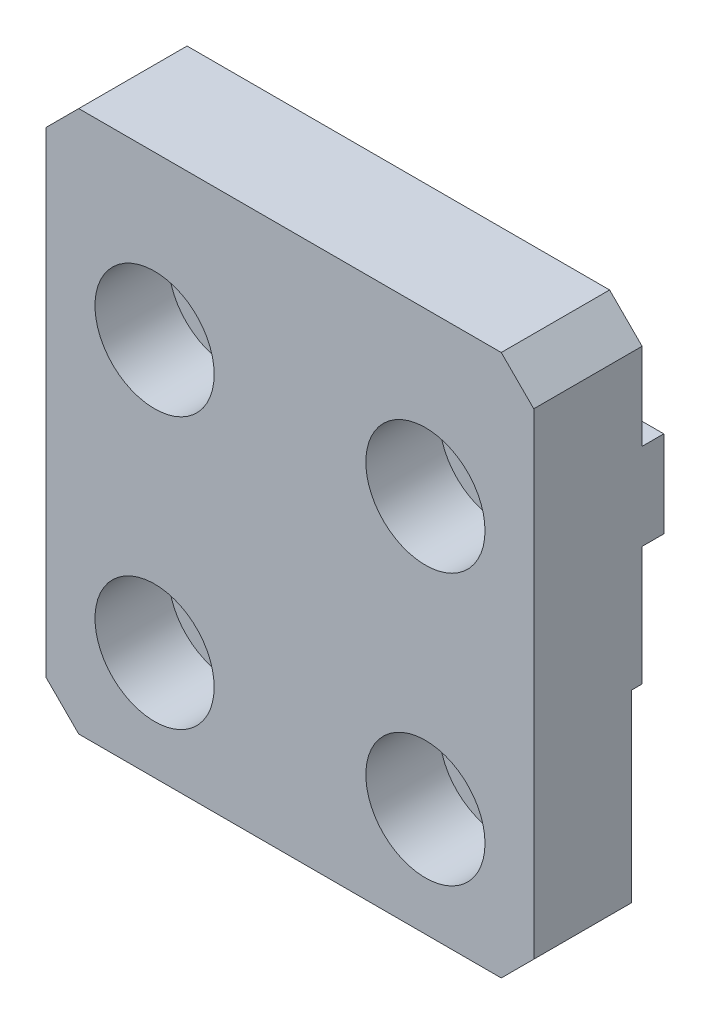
ISO-10303-21;
HEADER;
FILE_DESCRIPTION(('STEP AP214'),'2;1');
FILE_NAME('part.step','',(''),(''),'','','');
FILE_SCHEMA(('AUTOMOTIVE_DESIGN { 1 0 10303 214 1 1 1 1 }'));
ENDSEC;
DATA;
#1=APPLICATION_CONTEXT('core data for automotive mechanical design processes');
#2=APPLICATION_PROTOCOL_DEFINITION('international standard','automotive_design',2000,#1);
#3=PRODUCT_CONTEXT('',#1,'mechanical');
#4=PRODUCT('Part','Part','',(#3));
#5=PRODUCT_RELATED_PRODUCT_CATEGORY('part','',(#4));
#6=PRODUCT_DEFINITION_FORMATION('','',#4);
#7=PRODUCT_DEFINITION_CONTEXT('part definition',#1,'design');
#8=PRODUCT_DEFINITION('design','',#6,#7);
#9=PRODUCT_DEFINITION_SHAPE('','',#8);
#10=(LENGTH_UNIT() NAMED_UNIT(*) SI_UNIT(.MILLI.,.METRE.));
#11=(NAMED_UNIT(*) PLANE_ANGLE_UNIT() SI_UNIT($,.RADIAN.));
#12=(NAMED_UNIT(*) SI_UNIT($,.STERADIAN.) SOLID_ANGLE_UNIT());
#13=UNCERTAINTY_MEASURE_WITH_UNIT(LENGTH_MEASURE(1.E-05),#10,'distance_accuracy_value','');
#14=(GEOMETRIC_REPRESENTATION_CONTEXT(3) GLOBAL_UNCERTAINTY_ASSIGNED_CONTEXT((#13)) GLOBAL_UNIT_ASSIGNED_CONTEXT((#10,
#11,#12)) REPRESENTATION_CONTEXT('',''));
#15=CARTESIAN_POINT('',(0.,0.,0.));
#16=DIRECTION('',(0.,0.,1.));
#17=DIRECTION('',(1.,0.,0.));
#18=AXIS2_PLACEMENT_3D('',#15,#16,#17);
#19=CARTESIAN_POINT('',(0.,0.,0.));
#20=DIRECTION('',(0.,0.,-1.));
#21=DIRECTION('',(-1.,0.,0.));
#22=AXIS2_PLACEMENT_3D('',#19,#20,#21);
#23=PLANE('',#22);
#24=DIRECTION('',(-1.,0.,0.));
#25=VECTOR('',#24,1.);
#26=CARTESIAN_POINT('',(263.,20.,0.));
#27=LINE('',#26,#25);
#28=CARTESIAN_POINT('',(305.,20.,0.));
#29=VERTEX_POINT('',#28);
#30=CARTESIAN_POINT('',(266.,20.,0.));
#31=VERTEX_POINT('',#30);
#32=EDGE_CURVE('E230',#29,#31,#27,.T.);
#33=ORIENTED_EDGE('',*,*,#32,.F.);
#34=DIRECTION('',(-0.707106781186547,0.707106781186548,0.));
#35=VECTOR('',#34,1.);
#36=CARTESIAN_POINT('',(162.5,162.5,0.));
#37=LINE('',#36,#35);
#38=CARTESIAN_POINT('',(308.,17.,0.));
#39=VERTEX_POINT('',#38);
#40=EDGE_CURVE('E297',#29,#39,#37,.F.);
#41=ORIENTED_EDGE('',*,*,#40,.T.);
#42=DIRECTION('',(0.,1.,0.));
#43=VECTOR('',#42,1.);
#44=CARTESIAN_POINT('',(308.,-30.,0.));
#45=LINE('',#44,#43);
#46=CARTESIAN_POINT('',(308.,9.,0.));
#47=VERTEX_POINT('',#46);
#48=EDGE_CURVE('E231',#47,#39,#45,.T.);
#49=ORIENTED_EDGE('',*,*,#48,.F.);
#50=DIRECTION('',(-1.,0.,0.));
#51=VECTOR('',#50,1.);
#52=CARTESIAN_POINT('',(308.,9.,0.));
#53=LINE('',#52,#51);
#54=CARTESIAN_POINT('',(263.,9.,0.));
#55=VERTEX_POINT('',#54);
#56=EDGE_CURVE('E215',#47,#55,#53,.T.);
#57=ORIENTED_EDGE('',*,*,#56,.T.);
#58=DIRECTION('',(0.,-1.,0.));
#59=VECTOR('',#58,1.);
#60=CARTESIAN_POINT('',(263.,-30.,0.));
#61=LINE('',#60,#59);
#62=CARTESIAN_POINT('',(263.,17.,0.));
#63=VERTEX_POINT('',#62);
#64=EDGE_CURVE('E244',#63,#55,#61,.T.);
#65=ORIENTED_EDGE('',*,*,#64,.F.);
#66=DIRECTION('',(-0.707106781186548,-0.707106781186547,0.));
#67=VECTOR('',#66,1.);
#68=CARTESIAN_POINT('',(123.,-123.,0.));
#69=LINE('',#68,#67);
#70=EDGE_CURVE('E31',#63,#31,#69,.F.);
#71=ORIENTED_EDGE('',*,*,#70,.T.);
#72=EDGE_LOOP('',(#33,#41,#49,#57,#65,#71));
#73=FACE_BOUND('',#72,.T.);
#74=ADVANCED_FACE('F16',(#73),#23,.T.);
#75=CARTESIAN_POINT('',(263.,-30.,10.));
#76=DIRECTION('',(1.,0.,0.));
#77=DIRECTION('',(0.,0.,-1.));
#78=AXIS2_PLACEMENT_3D('',#75,#76,#77);
#79=PLANE('',#78);
#80=DIRECTION('',(0.,-1.,0.));
#81=VECTOR('',#80,1.);
#82=CARTESIAN_POINT('',(263.,-30.,10.));
#83=LINE('',#82,#81);
#84=CARTESIAN_POINT('',(263.,17.,10.));
#85=VERTEX_POINT('',#84);
#86=CARTESIAN_POINT('',(263.,-27.,10.));
#87=VERTEX_POINT('',#86);
#88=EDGE_CURVE('E254',#85,#87,#83,.T.);
#89=ORIENTED_EDGE('',*,*,#88,.F.);
#90=DIRECTION('',(0.,0.,-1.));
#91=VECTOR('',#90,1.);
#92=CARTESIAN_POINT('',(263.,17.,10.));
#93=LINE('',#92,#91);
#94=EDGE_CURVE('E11',#85,#63,#93,.T.);
#95=ORIENTED_EDGE('',*,*,#94,.T.);
#96=ORIENTED_EDGE('',*,*,#64,.T.);
#97=DIRECTION('',(0.,0.,-1.));
#98=VECTOR('',#97,1.);
#99=CARTESIAN_POINT('',(263.,9.,0.));
#100=LINE('',#99,#98);
#101=CARTESIAN_POINT('',(263.,9.,-2.));
#102=VERTEX_POINT('',#101);
#103=EDGE_CURVE('E202',#55,#102,#100,.T.);
#104=ORIENTED_EDGE('',*,*,#103,.T.);
#105=DIRECTION('',(0.,-1.,0.));
#106=VECTOR('',#105,1.);
#107=CARTESIAN_POINT('',(263.,1.,-2.));
#108=LINE('',#107,#106);
#109=CARTESIAN_POINT('',(263.,1.,-2.));
#110=VERTEX_POINT('',#109);
#111=EDGE_CURVE('E198',#102,#110,#108,.T.);
#112=ORIENTED_EDGE('',*,*,#111,.T.);
#113=DIRECTION('',(0.,0.,1.));
#114=VECTOR('',#113,1.);
#115=CARTESIAN_POINT('',(263.,1.,0.));
#116=LINE('',#115,#114);
#117=CARTESIAN_POINT('',(263.,1.,0.));
#118=VERTEX_POINT('',#117);
#119=EDGE_CURVE('E201',#110,#118,#116,.T.);
#120=ORIENTED_EDGE('',*,*,#119,.T.);
#121=CARTESIAN_POINT('',(263.,-10.,0.));
#122=VERTEX_POINT('',#121);
#123=EDGE_CURVE('E143',#118,#122,#61,.T.);
#124=ORIENTED_EDGE('',*,*,#123,.T.);
#125=DIRECTION('',(0.,0.,-1.));
#126=VECTOR('',#125,1.);
#127=CARTESIAN_POINT('',(263.,-10.,0.));
#128=LINE('',#127,#126);
#129=CARTESIAN_POINT('',(263.,-10.,1.));
#130=VERTEX_POINT('',#129);
#131=EDGE_CURVE('E127',#130,#122,#128,.T.);
#132=ORIENTED_EDGE('',*,*,#131,.F.);
#133=DIRECTION('',(0.,1.,0.));
#134=VECTOR('',#133,1.);
#135=CARTESIAN_POINT('',(263.,-30.,1.));
#136=LINE('',#135,#134);
#137=CARTESIAN_POINT('',(263.,-27.,1.));
#138=VERTEX_POINT('',#137);
#139=EDGE_CURVE('E117',#138,#130,#136,.T.);
#140=ORIENTED_EDGE('',*,*,#139,.F.);
#141=DIRECTION('',(0.,0.,1.));
#142=VECTOR('',#141,1.);
#143=CARTESIAN_POINT('',(263.,-27.,10.));
#144=LINE('',#143,#142);
#145=EDGE_CURVE('E24',#138,#87,#144,.T.);
#146=ORIENTED_EDGE('',*,*,#145,.T.);
#147=EDGE_LOOP('',(#89,#95,#96,#104,#112,#120,#124,#132,#140,#146));
#148=FACE_BOUND('',#147,.T.);
#149=ADVANCED_FACE('F140',(#148),#79,.F.);
#150=CARTESIAN_POINT('',(263.,-30.,10.));
#151=DIRECTION('',(0.,1.,0.));
#152=DIRECTION('',(0.,0.,1.));
#153=AXIS2_PLACEMENT_3D('',#150,#151,#152);
#154=PLANE('',#153);
#155=DIRECTION('',(-1.,0.,0.));
#156=VECTOR('',#155,1.);
#157=CARTESIAN_POINT('',(308.00005,-30.,1.));
#158=LINE('',#157,#156);
#159=CARTESIAN_POINT('',(305.,-30.,1.));
#160=VERTEX_POINT('',#159);
#161=CARTESIAN_POINT('',(266.,-30.,1.));
#162=VERTEX_POINT('',#161);
#163=EDGE_CURVE('E136',#160,#162,#158,.T.);
#164=ORIENTED_EDGE('',*,*,#163,.F.);
#165=DIRECTION('',(0.,0.,1.));
#166=VECTOR('',#165,1.);
#167=CARTESIAN_POINT('',(305.,-30.,10.));
#168=LINE('',#167,#166);
#169=CARTESIAN_POINT('',(305.,-30.,10.));
#170=VERTEX_POINT('',#169);
#171=EDGE_CURVE('E280',#160,#170,#168,.T.);
#172=ORIENTED_EDGE('',*,*,#171,.T.);
#173=DIRECTION('',(1.,0.,0.));
#174=VECTOR('',#173,1.);
#175=CARTESIAN_POINT('',(263.,-30.,10.));
#176=LINE('',#175,#174);
#177=CARTESIAN_POINT('',(266.,-30.,10.));
#178=VERTEX_POINT('',#177);
#179=EDGE_CURVE('E257',#178,#170,#176,.T.);
#180=ORIENTED_EDGE('',*,*,#179,.F.);
#181=DIRECTION('',(0.,0.,-1.));
#182=VECTOR('',#181,1.);
#183=CARTESIAN_POINT('',(266.,-30.,10.));
#184=LINE('',#183,#182);
#185=EDGE_CURVE('E277',#178,#162,#184,.T.);
#186=ORIENTED_EDGE('',*,*,#185,.T.);
#187=EDGE_LOOP('',(#164,#172,#180,#186));
#188=FACE_BOUND('',#187,.T.);
#189=ADVANCED_FACE('F305',(#188),#154,.F.);
#190=CARTESIAN_POINT('',(308.,-30.,10.));
#191=DIRECTION('',(-1.,0.,0.));
#192=DIRECTION('',(0.,0.,1.));
#193=AXIS2_PLACEMENT_3D('',#190,#191,#192);
#194=PLANE('',#193);
#195=DIRECTION('',(0.,1.,0.));
#196=VECTOR('',#195,1.);
#197=CARTESIAN_POINT('',(308.,-30.,10.));
#198=LINE('',#197,#196);
#199=CARTESIAN_POINT('',(308.,-27.,10.));
#200=VERTEX_POINT('',#199);
#201=CARTESIAN_POINT('',(308.,17.,10.));
#202=VERTEX_POINT('',#201);
#203=EDGE_CURVE('E260',#200,#202,#198,.T.);
#204=ORIENTED_EDGE('',*,*,#203,.F.);
#205=DIRECTION('',(0.,0.,-1.));
#206=VECTOR('',#205,1.);
#207=CARTESIAN_POINT('',(308.,-27.,10.));
#208=LINE('',#207,#206);
#209=CARTESIAN_POINT('',(308.,-27.,1.));
#210=VERTEX_POINT('',#209);
#211=EDGE_CURVE('E267',#200,#210,#208,.T.);
#212=ORIENTED_EDGE('',*,*,#211,.T.);
#213=DIRECTION('',(0.,1.,0.));
#214=VECTOR('',#213,1.);
#215=CARTESIAN_POINT('',(308.,-30.,1.));
#216=LINE('',#215,#214);
#217=CARTESIAN_POINT('',(308.,-10.,1.));
#218=VERTEX_POINT('',#217);
#219=EDGE_CURVE('E152',#210,#218,#216,.T.);
#220=ORIENTED_EDGE('',*,*,#219,.T.);
#221=DIRECTION('',(0.,0.,-1.));
#222=VECTOR('',#221,1.);
#223=CARTESIAN_POINT('',(308.,-10.,10.));
#224=LINE('',#223,#222);
#225=CARTESIAN_POINT('',(308.,-10.,0.));
#226=VERTEX_POINT('',#225);
#227=EDGE_CURVE('E134',#218,#226,#224,.T.);
#228=ORIENTED_EDGE('',*,*,#227,.T.);
#229=CARTESIAN_POINT('',(308.,1.,0.));
#230=VERTEX_POINT('',#229);
#231=EDGE_CURVE('E227',#226,#230,#45,.T.);
#232=ORIENTED_EDGE('',*,*,#231,.T.);
#233=DIRECTION('',(0.,0.,1.));
#234=VECTOR('',#233,1.);
#235=CARTESIAN_POINT('',(308.,1.,0.));
#236=LINE('',#235,#234);
#237=CARTESIAN_POINT('',(308.,1.,-2.));
#238=VERTEX_POINT('',#237);
#239=EDGE_CURVE('E196',#238,#230,#236,.T.);
#240=ORIENTED_EDGE('',*,*,#239,.F.);
#241=DIRECTION('',(0.,-1.,0.));
#242=VECTOR('',#241,1.);
#243=CARTESIAN_POINT('',(308.,1.,-2.));
#244=LINE('',#243,#242);
#245=CARTESIAN_POINT('',(308.,9.,-2.));
#246=VERTEX_POINT('',#245);
#247=EDGE_CURVE('E193',#246,#238,#244,.T.);
#248=ORIENTED_EDGE('',*,*,#247,.F.);
#249=DIRECTION('',(0.,0.,-1.));
#250=VECTOR('',#249,1.);
#251=CARTESIAN_POINT('',(308.,9.,0.));
#252=LINE('',#251,#250);
#253=EDGE_CURVE('E197',#47,#246,#252,.T.);
#254=ORIENTED_EDGE('',*,*,#253,.F.);
#255=ORIENTED_EDGE('',*,*,#48,.T.);
#256=DIRECTION('',(0.,0.,1.));
#257=VECTOR('',#256,1.);
#258=CARTESIAN_POINT('',(308.,17.,10.));
#259=LINE('',#258,#257);
#260=EDGE_CURVE('E232',#39,#202,#259,.T.);
#261=ORIENTED_EDGE('',*,*,#260,.T.);
#262=EDGE_LOOP('',(#204,#212,#220,#228,#232,#240,#248,#254,#255,#261));
#263=FACE_BOUND('',#262,.T.);
#264=ADVANCED_FACE('F311',(#263),#194,.F.);
#265=CARTESIAN_POINT('',(263.,20.,10.));
#266=DIRECTION('',(0.,-1.,0.));
#267=DIRECTION('',(0.,0.,-1.));
#268=AXIS2_PLACEMENT_3D('',#265,#266,#267);
#269=PLANE('',#268);
#270=DIRECTION('',(-1.,0.,0.));
#271=VECTOR('',#270,1.);
#272=CARTESIAN_POINT('',(263.,20.,10.));
#273=LINE('',#272,#271);
#274=CARTESIAN_POINT('',(305.,20.,10.));
#275=VERTEX_POINT('',#274);
#276=CARTESIAN_POINT('',(266.,20.,10.));
#277=VERTEX_POINT('',#276);
#278=EDGE_CURVE('E262',#275,#277,#273,.T.);
#279=ORIENTED_EDGE('',*,*,#278,.F.);
#280=DIRECTION('',(0.,0.,-1.));
#281=VECTOR('',#280,1.);
#282=CARTESIAN_POINT('',(305.,20.,10.));
#283=LINE('',#282,#281);
#284=EDGE_CURVE('E292',#275,#29,#283,.T.);
#285=ORIENTED_EDGE('',*,*,#284,.T.);
#286=ORIENTED_EDGE('',*,*,#32,.T.);
#287=DIRECTION('',(0.,0.,1.));
#288=VECTOR('',#287,1.);
#289=CARTESIAN_POINT('',(266.,20.,10.));
#290=LINE('',#289,#288);
#291=EDGE_CURVE('E290',#31,#277,#290,.T.);
#292=ORIENTED_EDGE('',*,*,#291,.T.);
#293=EDGE_LOOP('',(#279,#285,#286,#292));
#294=FACE_BOUND('',#293,.T.);
#295=ADVANCED_FACE('F313',(#294),#269,.F.);
#296=CARTESIAN_POINT('',(0.,0.,10.));
#297=DIRECTION('',(0.,0.,-1.));
#298=DIRECTION('',(-1.,0.,0.));
#299=AXIS2_PLACEMENT_3D('',#296,#297,#298);
#300=PLANE('',#299);
#301=CARTESIAN_POINT('',(273.,-20.,10.));
#302=DIRECTION('',(0.,0.,1.));
#303=DIRECTION('',(1.,0.,0.));
#304=AXIS2_PLACEMENT_3D('',#301,#302,#303);
#305=CIRCLE('',#304,5.5);
#306=CARTESIAN_POINT('',(278.5,-20.,10.));
#307=VERTEX_POINT('',#306);
#308=EDGE_CURVE('E155',#307,#307,#305,.T.);
#309=ORIENTED_EDGE('',*,*,#308,.F.);
#310=EDGE_LOOP('',(#309));
#311=FACE_BOUND('',#310,.T.);
#312=CARTESIAN_POINT('',(298.,-20.,10.));
#313=DIRECTION('',(0.,0.,1.));
#314=DIRECTION('',(1.,0.,0.));
#315=AXIS2_PLACEMENT_3D('',#312,#313,#314);
#316=CIRCLE('',#315,5.5);
#317=CARTESIAN_POINT('',(303.5,-20.,10.));
#318=VERTEX_POINT('',#317);
#319=EDGE_CURVE('E164',#318,#318,#316,.T.);
#320=ORIENTED_EDGE('',*,*,#319,.F.);
#321=EDGE_LOOP('',(#320));
#322=FACE_BOUND('',#321,.T.);
#323=CARTESIAN_POINT('',(273.,5.,10.));
#324=DIRECTION('',(0.,0.,1.));
#325=DIRECTION('',(1.,0.,0.));
#326=AXIS2_PLACEMENT_3D('',#323,#324,#325);
#327=CIRCLE('',#326,5.5);
#328=CARTESIAN_POINT('',(278.5,5.,10.));
#329=VERTEX_POINT('',#328);
#330=EDGE_CURVE('E173',#329,#329,#327,.T.);
#331=ORIENTED_EDGE('',*,*,#330,.F.);
#332=EDGE_LOOP('',(#331));
#333=FACE_BOUND('',#332,.T.);
#334=CARTESIAN_POINT('',(298.,5.,10.));
#335=DIRECTION('',(0.,0.,1.));
#336=DIRECTION('',(1.,0.,0.));
#337=AXIS2_PLACEMENT_3D('',#334,#335,#336);
#338=CIRCLE('',#337,5.5);
#339=CARTESIAN_POINT('',(303.5,5.,10.));
#340=VERTEX_POINT('',#339);
#341=EDGE_CURVE('E183',#340,#340,#338,.T.);
#342=ORIENTED_EDGE('',*,*,#341,.F.);
#343=EDGE_LOOP('',(#342));
#344=FACE_BOUND('',#343,.T.);
#345=ORIENTED_EDGE('',*,*,#179,.T.);
#346=DIRECTION('',(-0.707106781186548,-0.707106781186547,0.));
#347=VECTOR('',#346,1.);
#348=CARTESIAN_POINT('',(308.,-27.,10.));
#349=LINE('',#348,#347);
#350=EDGE_CURVE('E288',#170,#200,#349,.F.);
#351=ORIENTED_EDGE('',*,*,#350,.T.);
#352=ORIENTED_EDGE('',*,*,#203,.T.);
#353=DIRECTION('',(0.707106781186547,-0.707106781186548,0.));
#354=VECTOR('',#353,1.);
#355=CARTESIAN_POINT('',(305.,20.,10.));
#356=LINE('',#355,#354);
#357=EDGE_CURVE('E286',#202,#275,#356,.F.);
#358=ORIENTED_EDGE('',*,*,#357,.T.);
#359=ORIENTED_EDGE('',*,*,#278,.T.);
#360=DIRECTION('',(0.707106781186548,0.707106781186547,0.));
#361=VECTOR('',#360,1.);
#362=CARTESIAN_POINT('',(263.,17.,10.));
#363=LINE('',#362,#361);
#364=EDGE_CURVE('E284',#277,#85,#363,.F.);
#365=ORIENTED_EDGE('',*,*,#364,.T.);
#366=ORIENTED_EDGE('',*,*,#88,.T.);
#367=DIRECTION('',(-0.707106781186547,0.707106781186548,0.));
#368=VECTOR('',#367,1.);
#369=CARTESIAN_POINT('',(266.,-30.,10.));
#370=LINE('',#369,#368);
#371=EDGE_CURVE('E282',#87,#178,#370,.F.);
#372=ORIENTED_EDGE('',*,*,#371,.T.);
#373=EDGE_LOOP('',(#345,#351,#352,#358,#359,#365,#366,#372));
#374=FACE_BOUND('',#373,.T.);
#375=ADVANCED_FACE('F300',(#311,#322,#333,#344,#374),#300,.F.);
#376=DIRECTION('',(-1.,0.,0.));
#377=VECTOR('',#376,1.);
#378=CARTESIAN_POINT('',(308.00005,-10.,0.));
#379=LINE('',#378,#377);
#380=EDGE_CURVE('E135',#226,#122,#379,.T.);
#381=ORIENTED_EDGE('',*,*,#380,.T.);
#382=ORIENTED_EDGE('',*,*,#123,.F.);
#383=DIRECTION('',(-1.,0.,0.));
#384=VECTOR('',#383,1.);
#385=CARTESIAN_POINT('',(308.,1.,0.));
#386=LINE('',#385,#384);
#387=EDGE_CURVE('E208',#230,#118,#386,.T.);
#388=ORIENTED_EDGE('',*,*,#387,.F.);
#389=ORIENTED_EDGE('',*,*,#231,.F.);
#390=EDGE_LOOP('',(#381,#382,#388,#389));
#391=FACE_BOUND('',#390,.T.);
#392=ADVANCED_FACE('F326',(#391),#23,.T.);
#393=CARTESIAN_POINT('',(308.,1.,0.));
#394=DIRECTION('',(0.,-1.,0.));
#395=DIRECTION('',(0.,0.,-1.));
#396=AXIS2_PLACEMENT_3D('',#393,#394,#395);
#397=PLANE('',#396);
#398=ORIENTED_EDGE('',*,*,#119,.F.);
#399=DIRECTION('',(-1.,0.,0.));
#400=VECTOR('',#399,1.);
#401=CARTESIAN_POINT('',(308.,1.,-2.));
#402=LINE('',#401,#400);
#403=EDGE_CURVE('E205',#238,#110,#402,.T.);
#404=ORIENTED_EDGE('',*,*,#403,.F.);
#405=ORIENTED_EDGE('',*,*,#239,.T.);
#406=ORIENTED_EDGE('',*,*,#387,.T.);
#407=EDGE_LOOP('',(#398,#404,#405,#406));
#408=FACE_BOUND('',#407,.T.);
#409=ADVANCED_FACE('F334',(#408),#397,.T.);
#410=CARTESIAN_POINT('',(308.,1.,-2.));
#411=DIRECTION('',(0.,0.,-1.));
#412=DIRECTION('',(-1.,0.,0.));
#413=AXIS2_PLACEMENT_3D('',#410,#411,#412);
#414=PLANE('',#413);
#415=CARTESIAN_POINT('',(273.,5.,-2.));
#416=DIRECTION('',(0.,0.,-1.));
#417=DIRECTION('',(-1.,0.,0.));
#418=AXIS2_PLACEMENT_3D('',#415,#416,#417);
#419=CIRCLE('',#418,3.3);
#420=CARTESIAN_POINT('',(269.7,5.,-2.));
#421=VERTEX_POINT('',#420);
#422=EDGE_CURVE('E182',#421,#421,#419,.T.);
#423=ORIENTED_EDGE('',*,*,#422,.F.);
#424=EDGE_LOOP('',(#423));
#425=FACE_BOUND('',#424,.T.);
#426=CARTESIAN_POINT('',(298.,5.,-2.));
#427=DIRECTION('',(0.,0.,-1.));
#428=DIRECTION('',(-1.,0.,0.));
#429=AXIS2_PLACEMENT_3D('',#426,#427,#428);
#430=CIRCLE('',#429,3.3);
#431=CARTESIAN_POINT('',(294.7,5.,-2.));
#432=VERTEX_POINT('',#431);
#433=EDGE_CURVE('E192',#432,#432,#430,.T.);
#434=ORIENTED_EDGE('',*,*,#433,.F.);
#435=EDGE_LOOP('',(#434));
#436=FACE_BOUND('',#435,.T.);
#437=ORIENTED_EDGE('',*,*,#111,.F.);
#438=DIRECTION('',(-1.,0.,0.));
#439=VECTOR('',#438,1.);
#440=CARTESIAN_POINT('',(308.,9.,-2.));
#441=LINE('',#440,#439);
#442=EDGE_CURVE('E251',#246,#102,#441,.T.);
#443=ORIENTED_EDGE('',*,*,#442,.F.);
#444=ORIENTED_EDGE('',*,*,#247,.T.);
#445=ORIENTED_EDGE('',*,*,#403,.T.);
#446=EDGE_LOOP('',(#437,#443,#444,#445));
#447=FACE_BOUND('',#446,.T.);
#448=ADVANCED_FACE('F341',(#425,#436,#447),#414,.T.);
#449=CARTESIAN_POINT('',(308.,9.,0.));
#450=DIRECTION('',(0.,1.,0.));
#451=DIRECTION('',(0.,0.,1.));
#452=AXIS2_PLACEMENT_3D('',#449,#450,#451);
#453=PLANE('',#452);
#454=ORIENTED_EDGE('',*,*,#103,.F.);
#455=ORIENTED_EDGE('',*,*,#56,.F.);
#456=ORIENTED_EDGE('',*,*,#253,.T.);
#457=ORIENTED_EDGE('',*,*,#442,.T.);
#458=EDGE_LOOP('',(#454,#455,#456,#457));
#459=FACE_BOUND('',#458,.T.);
#460=ADVANCED_FACE('F357',(#459),#453,.T.);
#461=CARTESIAN_POINT('',(298.,5.,10.));
#462=DIRECTION('',(0.,0.,1.));
#463=DIRECTION('',(1.,0.,0.));
#464=AXIS2_PLACEMENT_3D('',#461,#462,#463);
#465=CYLINDRICAL_SURFACE('',#464,3.3);
#466=ORIENTED_EDGE('',*,*,#433,.T.);
#467=EDGE_LOOP('',(#466));
#468=FACE_BOUND('',#467,.T.);
#469=CARTESIAN_POINT('',(298.,5.,3.2));
#470=DIRECTION('',(0.,0.,1.));
#471=DIRECTION('',(1.,0.,0.));
#472=AXIS2_PLACEMENT_3D('',#469,#470,#471);
#473=CIRCLE('',#472,3.3);
#474=CARTESIAN_POINT('',(301.3,5.,3.2));
#475=VERTEX_POINT('',#474);
#476=EDGE_CURVE('E189',#475,#475,#473,.T.);
#477=ORIENTED_EDGE('',*,*,#476,.T.);
#478=EDGE_LOOP('',(#477));
#479=FACE_BOUND('',#478,.T.);
#480=ADVANCED_FACE('F428',(#468,#479),#465,.F.);
#481=CARTESIAN_POINT('',(301.3,5.,3.2));
#482=DIRECTION('',(0.,0.,-1.));
#483=DIRECTION('',(-1.,0.,0.));
#484=AXIS2_PLACEMENT_3D('',#481,#482,#483);
#485=PLANE('',#484);
#486=ORIENTED_EDGE('',*,*,#476,.F.);
#487=EDGE_LOOP('',(#486));
#488=FACE_BOUND('',#487,.T.);
#489=CARTESIAN_POINT('',(298.,5.,3.2));
#490=DIRECTION('',(0.,0.,1.));
#491=DIRECTION('',(1.,0.,0.));
#492=AXIS2_PLACEMENT_3D('',#489,#490,#491);
#493=CIRCLE('',#492,5.5);
#494=CARTESIAN_POINT('',(303.5,5.,3.2));
#495=VERTEX_POINT('',#494);
#496=EDGE_CURVE('E186',#495,#495,#493,.T.);
#497=ORIENTED_EDGE('',*,*,#496,.T.);
#498=EDGE_LOOP('',(#497));
#499=FACE_BOUND('',#498,.T.);
#500=ADVANCED_FACE('F424',(#488,#499),#485,.F.);
#501=CARTESIAN_POINT('',(298.,5.,10.));
#502=DIRECTION('',(0.,0.,1.));
#503=DIRECTION('',(1.,0.,0.));
#504=AXIS2_PLACEMENT_3D('',#501,#502,#503);
#505=CYLINDRICAL_SURFACE('',#504,5.5);
#506=ORIENTED_EDGE('',*,*,#496,.F.);
#507=EDGE_LOOP('',(#506));
#508=FACE_BOUND('',#507,.T.);
#509=ORIENTED_EDGE('',*,*,#341,.T.);
#510=EDGE_LOOP('',(#509));
#511=FACE_BOUND('',#510,.T.);
#512=ADVANCED_FACE('F420',(#508,#511),#505,.F.);
#513=CARTESIAN_POINT('',(273.,5.,10.));
#514=DIRECTION('',(0.,0.,1.));
#515=DIRECTION('',(1.,0.,0.));
#516=AXIS2_PLACEMENT_3D('',#513,#514,#515);
#517=CYLINDRICAL_SURFACE('',#516,3.3);
#518=ORIENTED_EDGE('',*,*,#422,.T.);
#519=EDGE_LOOP('',(#518));
#520=FACE_BOUND('',#519,.T.);
#521=CARTESIAN_POINT('',(273.,5.,3.2));
#522=DIRECTION('',(0.,0.,1.));
#523=DIRECTION('',(1.,0.,0.));
#524=AXIS2_PLACEMENT_3D('',#521,#522,#523);
#525=CIRCLE('',#524,3.3);
#526=CARTESIAN_POINT('',(276.3,5.,3.2));
#527=VERTEX_POINT('',#526);
#528=EDGE_CURVE('E179',#527,#527,#525,.T.);
#529=ORIENTED_EDGE('',*,*,#528,.T.);
#530=EDGE_LOOP('',(#529));
#531=FACE_BOUND('',#530,.T.);
#532=ADVANCED_FACE('F416',(#520,#531),#517,.F.);
#533=CARTESIAN_POINT('',(276.3,5.,3.2));
#534=DIRECTION('',(0.,0.,-1.));
#535=DIRECTION('',(-1.,0.,0.));
#536=AXIS2_PLACEMENT_3D('',#533,#534,#535);
#537=PLANE('',#536);
#538=ORIENTED_EDGE('',*,*,#528,.F.);
#539=EDGE_LOOP('',(#538));
#540=FACE_BOUND('',#539,.T.);
#541=CARTESIAN_POINT('',(273.,5.,3.2));
#542=DIRECTION('',(0.,0.,1.));
#543=DIRECTION('',(1.,0.,0.));
#544=AXIS2_PLACEMENT_3D('',#541,#542,#543);
#545=CIRCLE('',#544,5.5);
#546=CARTESIAN_POINT('',(278.5,5.,3.2));
#547=VERTEX_POINT('',#546);
#548=EDGE_CURVE('E176',#547,#547,#545,.T.);
#549=ORIENTED_EDGE('',*,*,#548,.T.);
#550=EDGE_LOOP('',(#549));
#551=FACE_BOUND('',#550,.T.);
#552=ADVANCED_FACE('F412',(#540,#551),#537,.F.);
#553=CARTESIAN_POINT('',(273.,5.,10.));
#554=DIRECTION('',(0.,0.,1.));
#555=DIRECTION('',(1.,0.,0.));
#556=AXIS2_PLACEMENT_3D('',#553,#554,#555);
#557=CYLINDRICAL_SURFACE('',#556,5.5);
#558=ORIENTED_EDGE('',*,*,#548,.F.);
#559=EDGE_LOOP('',(#558));
#560=FACE_BOUND('',#559,.T.);
#561=ORIENTED_EDGE('',*,*,#330,.T.);
#562=EDGE_LOOP('',(#561));
#563=FACE_BOUND('',#562,.T.);
#564=ADVANCED_FACE('F408',(#560,#563),#557,.F.);
#565=CARTESIAN_POINT('',(298.,-20.,10.));
#566=DIRECTION('',(0.,0.,1.));
#567=DIRECTION('',(1.,0.,0.));
#568=AXIS2_PLACEMENT_3D('',#565,#566,#567);
#569=CYLINDRICAL_SURFACE('',#568,3.3);
#570=CARTESIAN_POINT('',(298.,-20.,1.));
#571=DIRECTION('',(0.,0.,1.));
#572=DIRECTION('',(1.,0.,0.));
#573=AXIS2_PLACEMENT_3D('',#570,#571,#572);
#574=CIRCLE('',#573,3.3);
#575=CARTESIAN_POINT('',(301.3,-20.,1.));
#576=VERTEX_POINT('',#575);
#577=EDGE_CURVE('E149',#576,#576,#574,.F.);
#578=ORIENTED_EDGE('',*,*,#577,.T.);
#579=EDGE_LOOP('',(#578));
#580=FACE_BOUND('',#579,.T.);
#581=CARTESIAN_POINT('',(298.,-20.,3.2));
#582=DIRECTION('',(0.,0.,1.));
#583=DIRECTION('',(1.,0.,0.));
#584=AXIS2_PLACEMENT_3D('',#581,#582,#583);
#585=CIRCLE('',#584,3.3);
#586=CARTESIAN_POINT('',(301.3,-20.,3.2));
#587=VERTEX_POINT('',#586);
#588=EDGE_CURVE('E170',#587,#587,#585,.T.);
#589=ORIENTED_EDGE('',*,*,#588,.T.);
#590=EDGE_LOOP('',(#589));
#591=FACE_BOUND('',#590,.T.);
#592=ADVANCED_FACE('F404',(#580,#591),#569,.F.);
#593=CARTESIAN_POINT('',(301.3,-20.,3.2));
#594=DIRECTION('',(0.,0.,-1.));
#595=DIRECTION('',(-1.,0.,0.));
#596=AXIS2_PLACEMENT_3D('',#593,#594,#595);
#597=PLANE('',#596);
#598=ORIENTED_EDGE('',*,*,#588,.F.);
#599=EDGE_LOOP('',(#598));
#600=FACE_BOUND('',#599,.T.);
#601=CARTESIAN_POINT('',(298.,-20.,3.2));
#602=DIRECTION('',(0.,0.,1.));
#603=DIRECTION('',(1.,0.,0.));
#604=AXIS2_PLACEMENT_3D('',#601,#602,#603);
#605=CIRCLE('',#604,5.5);
#606=CARTESIAN_POINT('',(303.5,-20.,3.2));
#607=VERTEX_POINT('',#606);
#608=EDGE_CURVE('E167',#607,#607,#605,.T.);
#609=ORIENTED_EDGE('',*,*,#608,.T.);
#610=EDGE_LOOP('',(#609));
#611=FACE_BOUND('',#610,.T.);
#612=ADVANCED_FACE('F400',(#600,#611),#597,.F.);
#613=CARTESIAN_POINT('',(298.,-20.,10.));
#614=DIRECTION('',(0.,0.,1.));
#615=DIRECTION('',(1.,0.,0.));
#616=AXIS2_PLACEMENT_3D('',#613,#614,#615);
#617=CYLINDRICAL_SURFACE('',#616,5.5);
#618=ORIENTED_EDGE('',*,*,#608,.F.);
#619=EDGE_LOOP('',(#618));
#620=FACE_BOUND('',#619,.T.);
#621=ORIENTED_EDGE('',*,*,#319,.T.);
#622=EDGE_LOOP('',(#621));
#623=FACE_BOUND('',#622,.T.);
#624=ADVANCED_FACE('F396',(#620,#623),#617,.F.);
#625=CARTESIAN_POINT('',(273.,-20.,10.));
#626=DIRECTION('',(0.,0.,1.));
#627=DIRECTION('',(1.,0.,0.));
#628=AXIS2_PLACEMENT_3D('',#625,#626,#627);
#629=CYLINDRICAL_SURFACE('',#628,3.3);
#630=CARTESIAN_POINT('',(273.,-20.,1.));
#631=DIRECTION('',(0.,0.,1.));
#632=DIRECTION('',(1.,0.,0.));
#633=AXIS2_PLACEMENT_3D('',#630,#631,#632);
#634=CIRCLE('',#633,3.3);
#635=CARTESIAN_POINT('',(276.3,-20.,1.));
#636=VERTEX_POINT('',#635);
#637=EDGE_CURVE('E147',#636,#636,#634,.F.);
#638=ORIENTED_EDGE('',*,*,#637,.T.);
#639=EDGE_LOOP('',(#638));
#640=FACE_BOUND('',#639,.T.);
#641=CARTESIAN_POINT('',(273.,-20.,3.2));
#642=DIRECTION('',(0.,0.,1.));
#643=DIRECTION('',(1.,0.,0.));
#644=AXIS2_PLACEMENT_3D('',#641,#642,#643);
#645=CIRCLE('',#644,3.3);
#646=CARTESIAN_POINT('',(276.3,-20.,3.2));
#647=VERTEX_POINT('',#646);
#648=EDGE_CURVE('E161',#647,#647,#645,.T.);
#649=ORIENTED_EDGE('',*,*,#648,.T.);
#650=EDGE_LOOP('',(#649));
#651=FACE_BOUND('',#650,.T.);
#652=ADVANCED_FACE('F392',(#640,#651),#629,.F.);
#653=CARTESIAN_POINT('',(276.3,-20.,3.2));
#654=DIRECTION('',(0.,0.,-1.));
#655=DIRECTION('',(-1.,0.,0.));
#656=AXIS2_PLACEMENT_3D('',#653,#654,#655);
#657=PLANE('',#656);
#658=ORIENTED_EDGE('',*,*,#648,.F.);
#659=EDGE_LOOP('',(#658));
#660=FACE_BOUND('',#659,.T.);
#661=CARTESIAN_POINT('',(273.,-20.,3.2));
#662=DIRECTION('',(0.,0.,1.));
#663=DIRECTION('',(1.,0.,0.));
#664=AXIS2_PLACEMENT_3D('',#661,#662,#663);
#665=CIRCLE('',#664,5.5);
#666=CARTESIAN_POINT('',(278.5,-20.,3.2));
#667=VERTEX_POINT('',#666);
#668=EDGE_CURVE('E158',#667,#667,#665,.T.);
#669=ORIENTED_EDGE('',*,*,#668,.T.);
#670=EDGE_LOOP('',(#669));
#671=FACE_BOUND('',#670,.T.);
#672=ADVANCED_FACE('F388',(#660,#671),#657,.F.);
#673=CARTESIAN_POINT('',(273.,-20.,10.));
#674=DIRECTION('',(0.,0.,1.));
#675=DIRECTION('',(1.,0.,0.));
#676=AXIS2_PLACEMENT_3D('',#673,#674,#675);
#677=CYLINDRICAL_SURFACE('',#676,5.5);
#678=ORIENTED_EDGE('',*,*,#668,.F.);
#679=EDGE_LOOP('',(#678));
#680=FACE_BOUND('',#679,.T.);
#681=ORIENTED_EDGE('',*,*,#308,.T.);
#682=EDGE_LOOP('',(#681));
#683=FACE_BOUND('',#682,.T.);
#684=ADVANCED_FACE('F381',(#680,#683),#677,.F.);
#685=CARTESIAN_POINT('',(308.00005,-10.,0.));
#686=DIRECTION('',(0.,1.,0.));
#687=DIRECTION('',(0.,0.,1.));
#688=AXIS2_PLACEMENT_3D('',#685,#686,#687);
#689=PLANE('',#688);
#690=DIRECTION('',(-1.,0.,0.));
#691=VECTOR('',#690,1.);
#692=CARTESIAN_POINT('',(308.00005,-10.,1.));
#693=LINE('',#692,#691);
#694=EDGE_CURVE('E121',#218,#130,#693,.T.);
#695=ORIENTED_EDGE('',*,*,#694,.T.);
#696=ORIENTED_EDGE('',*,*,#131,.T.);
#697=ORIENTED_EDGE('',*,*,#380,.F.);
#698=ORIENTED_EDGE('',*,*,#227,.F.);
#699=EDGE_LOOP('',(#695,#696,#697,#698));
#700=FACE_BOUND('',#699,.T.);
#701=ADVANCED_FACE('F131',(#700),#689,.F.);
#702=CARTESIAN_POINT('',(308.00005,-30.,1.));
#703=DIRECTION('',(0.,0.,1.));
#704=DIRECTION('',(1.,0.,0.));
#705=AXIS2_PLACEMENT_3D('',#702,#703,#704);
#706=PLANE('',#705);
#707=ORIENTED_EDGE('',*,*,#637,.F.);
#708=EDGE_LOOP('',(#707));
#709=FACE_BOUND('',#708,.T.);
#710=ORIENTED_EDGE('',*,*,#577,.F.);
#711=EDGE_LOOP('',(#710));
#712=FACE_BOUND('',#711,.T.);
#713=ORIENTED_EDGE('',*,*,#219,.F.);
#714=DIRECTION('',(0.707106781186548,0.707106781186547,0.));
#715=VECTOR('',#714,1.);
#716=CARTESIAN_POINT('',(308.,-27.,1.));
#717=LINE('',#716,#715);
#718=EDGE_CURVE('E273',#210,#160,#717,.F.);
#719=ORIENTED_EDGE('',*,*,#718,.T.);
#720=ORIENTED_EDGE('',*,*,#163,.T.);
#721=DIRECTION('',(0.707106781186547,-0.707106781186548,0.));
#722=VECTOR('',#721,1.);
#723=CARTESIAN_POINT('',(266.,-30.,1.));
#724=LINE('',#723,#722);
#725=EDGE_CURVE('E123',#162,#138,#724,.F.);
#726=ORIENTED_EDGE('',*,*,#725,.T.);
#727=ORIENTED_EDGE('',*,*,#139,.T.);
#728=ORIENTED_EDGE('',*,*,#694,.F.);
#729=EDGE_LOOP('',(#713,#719,#720,#726,#727,#728));
#730=FACE_BOUND('',#729,.T.);
#731=ADVANCED_FACE('F120',(#709,#712,#730),#706,.F.);
#732=CARTESIAN_POINT('',(308.,-27.,10.));
#733=DIRECTION('',(-0.707106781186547,0.707106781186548,0.));
#734=DIRECTION('',(0.,0.,-1.));
#735=AXIS2_PLACEMENT_3D('',#732,#733,#734);
#736=PLANE('',#735);
#737=ORIENTED_EDGE('',*,*,#350,.F.);
#738=ORIENTED_EDGE('',*,*,#171,.F.);
#739=ORIENTED_EDGE('',*,*,#718,.F.);
#740=ORIENTED_EDGE('',*,*,#211,.F.);
#741=EDGE_LOOP('',(#737,#738,#739,#740));
#742=FACE_BOUND('',#741,.T.);
#743=ADVANCED_FACE('F309',(#742),#736,.F.);
#744=CARTESIAN_POINT('',(305.,20.,10.));
#745=DIRECTION('',(-0.707106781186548,-0.707106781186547,0.));
#746=DIRECTION('',(0.,0.,-1.));
#747=AXIS2_PLACEMENT_3D('',#744,#745,#746);
#748=PLANE('',#747);
#749=ORIENTED_EDGE('',*,*,#357,.F.);
#750=ORIENTED_EDGE('',*,*,#260,.F.);
#751=ORIENTED_EDGE('',*,*,#40,.F.);
#752=ORIENTED_EDGE('',*,*,#284,.F.);
#753=EDGE_LOOP('',(#749,#750,#751,#752));
#754=FACE_BOUND('',#753,.T.);
#755=ADVANCED_FACE('F359',(#754),#748,.F.);
#756=CARTESIAN_POINT('',(263.,17.,10.));
#757=DIRECTION('',(0.707106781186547,-0.707106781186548,0.));
#758=DIRECTION('',(0.,0.,-1.));
#759=AXIS2_PLACEMENT_3D('',#756,#757,#758);
#760=PLANE('',#759);
#761=ORIENTED_EDGE('',*,*,#364,.F.);
#762=ORIENTED_EDGE('',*,*,#291,.F.);
#763=ORIENTED_EDGE('',*,*,#70,.F.);
#764=ORIENTED_EDGE('',*,*,#94,.F.);
#765=EDGE_LOOP('',(#761,#762,#763,#764));
#766=FACE_BOUND('',#765,.T.);
#767=ADVANCED_FACE('F361',(#766),#760,.F.);
#768=CARTESIAN_POINT('',(266.,-30.,10.));
#769=DIRECTION('',(0.707106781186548,0.707106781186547,0.));
#770=DIRECTION('',(0.,0.,-1.));
#771=AXIS2_PLACEMENT_3D('',#768,#769,#770);
#772=PLANE('',#771);
#773=ORIENTED_EDGE('',*,*,#371,.F.);
#774=ORIENTED_EDGE('',*,*,#145,.F.);
#775=ORIENTED_EDGE('',*,*,#725,.F.);
#776=ORIENTED_EDGE('',*,*,#185,.F.);
#777=EDGE_LOOP('',(#773,#774,#775,#776));
#778=FACE_BOUND('',#777,.T.);
#779=ADVANCED_FACE('F18',(#778),#772,.F.);
#780=CLOSED_SHELL('',(#74,#149,#189,#264,#295,#375,#392,#409,#448,#460,#480,#500,#512,#532,#552,
#564,#592,#612,#624,#652,#672,#684,#701,#731,#743,#755,#767,#779));
#781=MANIFOLD_SOLID_BREP('B1',#780);
#782=ADVANCED_BREP_SHAPE_REPRESENTATION('',(#18,#781),#14);
#783=SHAPE_DEFINITION_REPRESENTATION(#9,#782);
ENDSEC;
END-ISO-10303-21;
